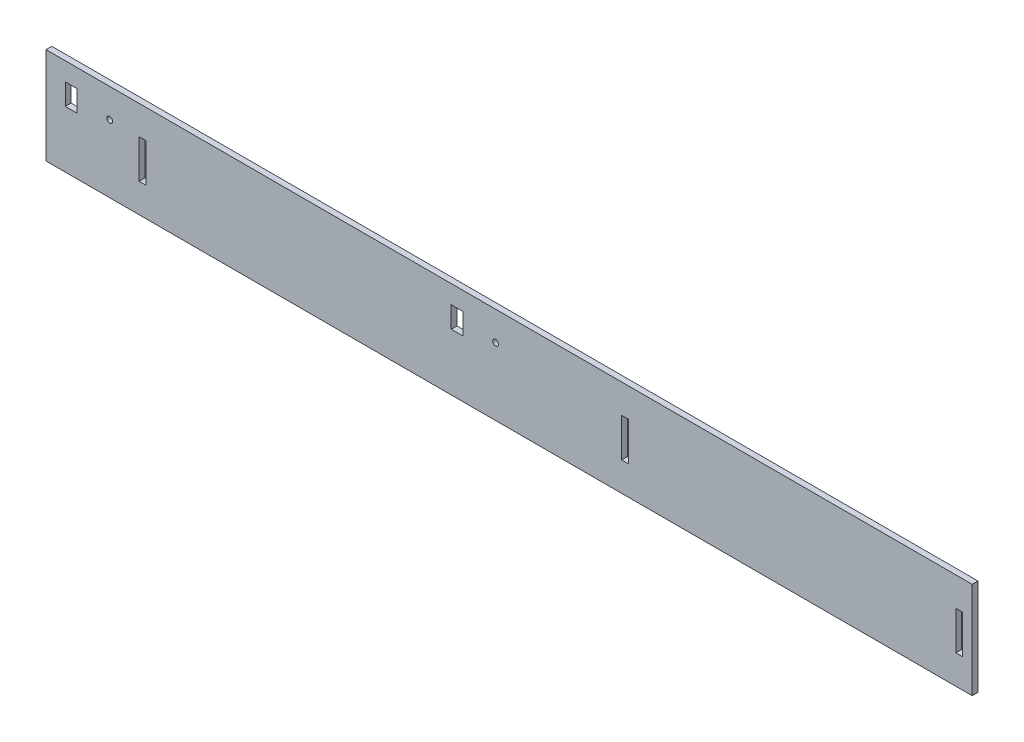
from build123d import *

# Parameters (mm, degrees)
ESQUISSE1_W        = 480
ESQUISSE1_H        = 50
ESQUISSE1_R        = 1.5
ESQUISSE1_W_2      = 6
ESQUISSE1_H_2      = 11
ESQUISSE1_W_3      = 3.5
ESQUISSE1_H_3      = 20
BOSS_EXTRU_1_DEPTH = 3


with BuildPart() as part:
    # Esquisse1 → Boss.-Extru.1 (new body)
    with BuildSketch(Plane.XY):
        with Locations((240, 25)):
            Rectangle(ESQUISSE1_W, ESQUISSE1_H)
        with Locations((33, 35)):
            Circle(ESQUISSE1_R, mode=Mode.SUBTRACT)
        with Locations((233, 35)):
            Circle(ESQUISSE1_R, mode=Mode.SUBTRACT)
        with Locations((213, 35)):
            Rectangle(ESQUISSE1_W_2, ESQUISSE1_H_2, mode=Mode.SUBTRACT)
        with Locations((13, 35)):
            Rectangle(ESQUISSE1_W_2, ESQUISSE1_H_2, mode=Mode.SUBTRACT)
        with Locations((50, 25)):
            Rectangle(ESQUISSE1_W_3, ESQUISSE1_H_3, mode=Mode.SUBTRACT)
        with Locations((300, 25)):
            Rectangle(ESQUISSE1_W_3, ESQUISSE1_H_3, mode=Mode.SUBTRACT)
        with Locations((473.25, 25)):
            Rectangle(ESQUISSE1_W_3, ESQUISSE1_H_3, mode=Mode.SUBTRACT)
    extrude(amount=BOSS_EXTRU_1_DEPTH)


solid = part.part
